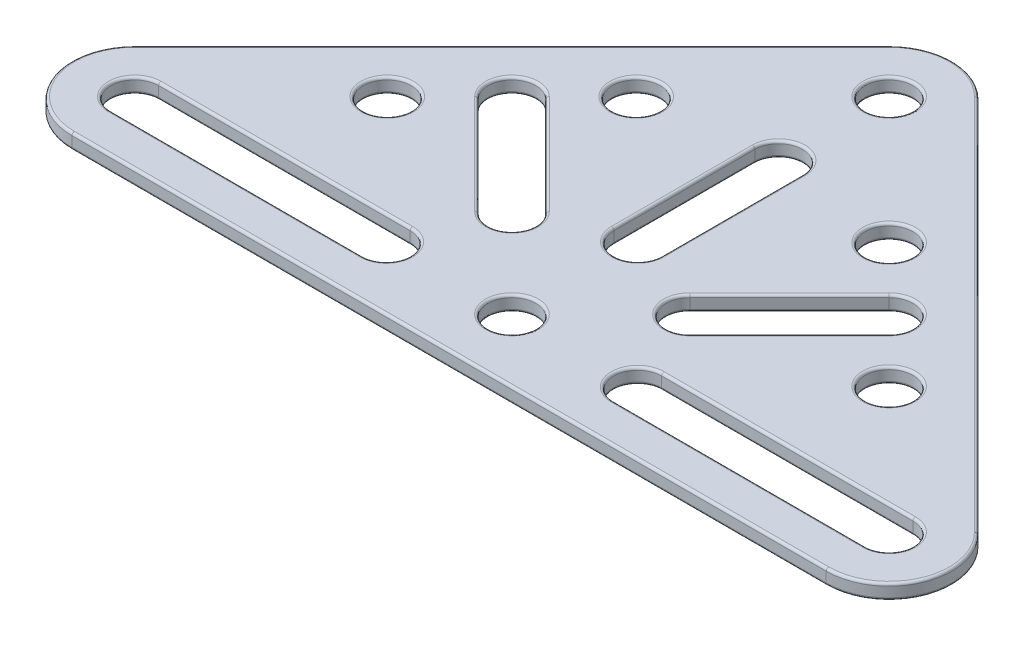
from build123d import *

# Parameters (mm, degrees)
SKETCH1_R          = 2.413
EXTRUDE1_DEPTH     = 1.524
CUT_EXTRUDE1_DEPTH = 111.288290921
CIRPATTERN1_COUNT  = 3
CIRPATTERN1_ANGLE  = 90
SKETCH3_R          = 2.413
CUT_EXTRUDE2_DEPTH = 111.288290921
FILLET1_R          = 0.254


with BuildPart() as part:
    # Sketch1 → Extrude1 (new body)
    with BuildSketch(Plane(origin=(0, 0, 0), x_dir=(1, 0, 0), z_dir=(0, 1, 0))):
        with BuildLine():
            Line((15.330256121, 0), (91.530256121, 0))
            ThreePointArc((91.530256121, 0), (97.396891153, 3.919960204), (96.020384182, 10.840128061))
            Line((96.020384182, 10.840128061), (57.920384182, 48.940128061))
            ThreePointArc((57.920384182, 48.940128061), (53.430256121, 50.8), (48.940128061, 48.940128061))
            Line((48.940128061, 48.940128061), (10.840128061, 10.840128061))
            ThreePointArc((10.840128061, 10.840128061), (9.46362109, 3.919960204), (15.330256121, 0))
        make_face()
        with Locations(Location((53.430256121, 44.45, 0), (0, 0, 90))):
            Circle(SKETCH1_R, mode=Mode.SUBTRACT)
        with Locations(Location((53.430256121, 6.35, 0), (0, 0, 90))):
            Circle(SKETCH1_R, mode=Mode.SUBTRACT)
    extrude(amount=EXTRUDE1_DEPTH)

    # Sketch2 → Cut-Extrude1 (cut, through all)
    with BuildSketch(Plane(origin=(0, 1.524, 0), x_dir=(-1, 0, 0), z_dir=(0, 1, 0))):
        with BuildLine():
            Line((-74.186504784, -23.693751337), (-64.128617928, -13.635864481))
            ThreePointArc((-64.128617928, -13.635864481), (-60.716120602, -13.635864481), (-60.716120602, -17.048361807))
            Line((-60.716120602, -17.048361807), (-70.774007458, -27.106248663))
            ThreePointArc((-70.774007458, -27.106248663), (-74.186504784, -27.106248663), (-74.186504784, -23.693751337))
        make_face()
    cut_extrude1 = extrude(amount=-CUT_EXTRUDE1_DEPTH, mode=Mode.SUBTRACT)

    # CirPattern1: Cut-Extrude1 ×3 about axis
    cirpattern1_axis = Axis((53.430256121, 0, -6.35), (0, 1, 0))
    for i in range(1, CIRPATTERN1_COUNT):
        add(cut_extrude1.rotate(cirpattern1_axis, i * CIRPATTERN1_ANGLE / (CIRPATTERN1_COUNT - 1)), mode=Mode.SUBTRACT)

    # Sketch3 → Cut-Extrude2 (cut, through all)
    with BuildSketch(Plane(origin=(0, 1.524, 0), x_dir=(-1, 0, 0), z_dir=(0, 1, 0))):
        with Locations(Location((-28.082219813, -19.101963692, 0), (0, 0, 90))):
            Circle(SKETCH3_R)
        with Locations(Location((-40.654578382, -31.674322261, 0), (0, 0, 90))):
            Circle(SKETCH3_R)
        with BuildLine():
            Line((-15.330256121, -8.763), (-40.730256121, -8.763))
            ThreePointArc((-40.730256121, -8.763), (-43.143256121, -6.35), (-40.730256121, -3.937))
            Line((-40.730256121, -3.937), (-15.330256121, -3.937))
            ThreePointArc((-15.330256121, -3.937), (-12.917256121, -6.35), (-15.330256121, -8.763))
        make_face()
    cut_extrude2 = extrude(amount=-CUT_EXTRUDE2_DEPTH, mode=Mode.SUBTRACT)

    # Mirror1: Cut-Extrude2 across plane
    add(cut_extrude2.mirror(Plane.ZY.offset(-53.430256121)), mode=Mode.SUBTRACT)

    # Fillet1
    fillet1_edges = [part.edges().sort_by_distance(p)[0] for p in [
        (9.46362109, 1.524, -3.919960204),
        (78.778292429, 1.524, -21.514963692),
        (78.778292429, 0, -21.514963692),
        (66.20593386, 1.524, -34.087322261),
        (66.20593386, 0, -34.087322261),
        (53.430256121, 1.524, 0),
        (53.430256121, 0, -42.037),
        (97.396891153, 1.524, -3.919960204),
        (53.430256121, 1.524, -42.037),
        (76.970384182, 1.524, -29.890128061),
        (53.430256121, 0, -3.937),
        (53.430256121, 1.524, -3.937),
        (74.186504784, 0, -27.106248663),
        (69.157561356, 0, -18.664807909),
        (60.716120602, 0, -13.635864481),
        (65.74506403, 0, -22.077305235),
        (74.186504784, 1.524, -27.106248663),
        (65.74506403, 1.524, -22.077305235),
        (60.716120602, 1.524, -13.635864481),
        (69.157561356, 1.524, -18.664807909),
        (53.430256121, 1.524, -50.8),
        (53.430256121, 1.524, -35.703768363),
        (51.017256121, 1.524, -26.178768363),
        (53.430256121, 1.524, -16.653768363),
        (55.843256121, 1.524, -26.178768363),
        (53.430256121, 0, -35.703768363),
        (55.843256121, 0, -26.178768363),
        (53.430256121, 0, -16.653768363),
        (51.017256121, 0, -26.178768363),
        (76.970384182, 0, -29.890128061),
        (32.674007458, 1.524, -27.106248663),
        (37.702950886, 1.524, -18.664807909),
        (46.14439164, 1.524, -13.635864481),
        (41.115448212, 1.524, -22.077305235),
        (32.674007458, 0, -27.106248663),
        (41.115448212, 0, -22.077305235),
        (46.14439164, 0, -13.635864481),
        (37.702950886, 0, -18.664807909),
        (97.396891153, 0, -3.919960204),
        (53.430256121, 0, 0),
        (9.46362109, 0, -3.919960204),
        (29.890128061, 1.524, -29.890128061),
        (29.890128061, 0, -29.890128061),
        (12.917256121, 0, -6.35),
        (28.030256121, 0, -8.763),
        (43.143256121, 0, -6.35),
        (28.030256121, 0, -3.937),
        (12.917256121, 1.524, -6.35),
        (28.030256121, 1.524, -3.937),
        (43.143256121, 1.524, -6.35),
        (28.030256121, 1.524, -8.763),
        (53.430256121, 0, -50.8),
        (28.082219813, 0, -21.514963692),
        (28.082219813, 1.524, -21.514963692),
        (40.654578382, 0, -34.087322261),
        (40.654578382, 1.524, -34.087322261),
        (93.943256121, 1.524, -6.35),
        (78.830256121, 1.524, -3.937),
        (63.717256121, 1.524, -6.35),
        (78.830256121, 1.524, -8.763),
        (93.943256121, 0, -6.35),
        (78.830256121, 0, -3.937),
        (63.717256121, 0, -6.35),
        (78.830256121, 0, -8.763),
    ]]
    fillet(fillet1_edges, radius=FILLET1_R)


solid = part.part
